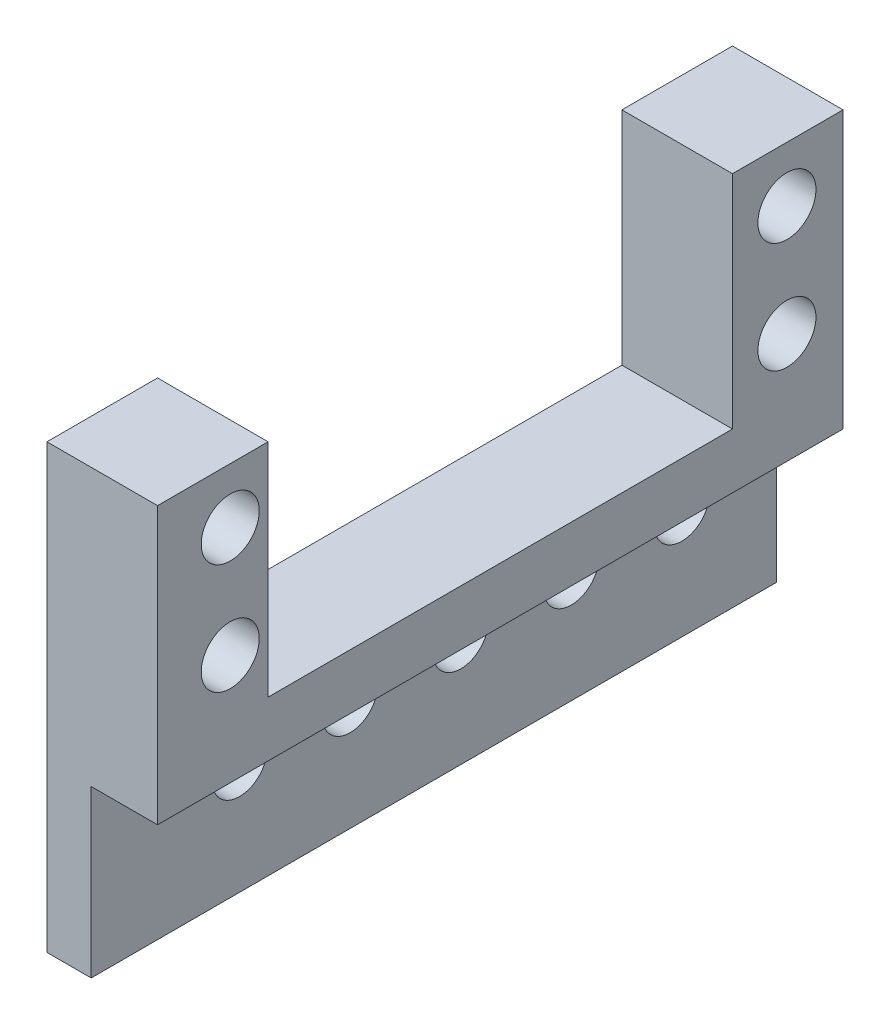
ISO-10303-21;
HEADER;
FILE_DESCRIPTION(('STEP AP214'),'2;1');
FILE_NAME('part.step','',(''),(''),'','','');
FILE_SCHEMA(('AUTOMOTIVE_DESIGN { 1 0 10303 214 1 1 1 1 }'));
ENDSEC;
DATA;
#1=APPLICATION_CONTEXT('core data for automotive mechanical design processes');
#2=APPLICATION_PROTOCOL_DEFINITION('international standard','automotive_design',2000,#1);
#3=PRODUCT_CONTEXT('',#1,'mechanical');
#4=PRODUCT('Part','Part','',(#3));
#5=PRODUCT_RELATED_PRODUCT_CATEGORY('part','',(#4));
#6=PRODUCT_DEFINITION_FORMATION('','',#4);
#7=PRODUCT_DEFINITION_CONTEXT('part definition',#1,'design');
#8=PRODUCT_DEFINITION('design','',#6,#7);
#9=PRODUCT_DEFINITION_SHAPE('','',#8);
#10=(LENGTH_UNIT() NAMED_UNIT(*) SI_UNIT(.MILLI.,.METRE.));
#11=(NAMED_UNIT(*) PLANE_ANGLE_UNIT() SI_UNIT($,.RADIAN.));
#12=(NAMED_UNIT(*) SI_UNIT($,.STERADIAN.) SOLID_ANGLE_UNIT());
#13=UNCERTAINTY_MEASURE_WITH_UNIT(LENGTH_MEASURE(1.E-05),#10,'distance_accuracy_value','');
#14=(GEOMETRIC_REPRESENTATION_CONTEXT(3) GLOBAL_UNCERTAINTY_ASSIGNED_CONTEXT((#13)) GLOBAL_UNIT_ASSIGNED_CONTEXT((#10,
#11,#12)) REPRESENTATION_CONTEXT('',''));
#15=CARTESIAN_POINT('',(0.,0.,0.));
#16=DIRECTION('',(0.,0.,1.));
#17=DIRECTION('',(1.,0.,0.));
#18=AXIS2_PLACEMENT_3D('',#15,#16,#17);
#19=CARTESIAN_POINT('',(0.,5.,0.));
#20=DIRECTION('',(1.,0.,0.));
#21=DIRECTION('',(0.,0.,-1.));
#22=AXIS2_PLACEMENT_3D('',#19,#20,#21);
#23=PLANE('',#22);
#24=CARTESIAN_POINT('',(0.,-5.,8.579278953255));
#25=DIRECTION('',(1.,0.,0.));
#26=DIRECTION('',(0.,0.,-1.));
#27=AXIS2_PLACEMENT_3D('',#24,#25,#26);
#28=CIRCLE('',#27,2.5);
#29=CARTESIAN_POINT('',(0.,-5.,6.079278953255));
#30=VERTEX_POINT('',#29);
#31=EDGE_CURVE('E155',#30,#30,#28,.T.);
#32=ORIENTED_EDGE('',*,*,#31,.T.);
#33=EDGE_LOOP('',(#32));
#34=FACE_BOUND('',#33,.T.);
#35=CARTESIAN_POINT('',(0.,-5.,18.579278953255));
#36=DIRECTION('',(1.,0.,0.));
#37=DIRECTION('',(0.,0.,-1.));
#38=AXIS2_PLACEMENT_3D('',#35,#36,#37);
#39=CIRCLE('',#38,2.5);
#40=CARTESIAN_POINT('',(0.,-5.,16.079278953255));
#41=VERTEX_POINT('',#40);
#42=EDGE_CURVE('E314',#41,#41,#39,.T.);
#43=ORIENTED_EDGE('',*,*,#42,.T.);
#44=EDGE_LOOP('',(#43));
#45=FACE_BOUND('',#44,.T.);
#46=CARTESIAN_POINT('',(0.,-5.,28.579278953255));
#47=DIRECTION('',(1.,0.,0.));
#48=DIRECTION('',(0.,0.,-1.));
#49=AXIS2_PLACEMENT_3D('',#46,#47,#48);
#50=CIRCLE('',#49,2.5);
#51=CARTESIAN_POINT('',(0.,-5.,26.079278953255));
#52=VERTEX_POINT('',#51);
#53=EDGE_CURVE('E318',#52,#52,#50,.T.);
#54=ORIENTED_EDGE('',*,*,#53,.T.);
#55=EDGE_LOOP('',(#54));
#56=FACE_BOUND('',#55,.T.);
#57=CARTESIAN_POINT('',(0.,-5.,38.579278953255));
#58=DIRECTION('',(1.,0.,0.));
#59=DIRECTION('',(0.,0.,-1.));
#60=AXIS2_PLACEMENT_3D('',#57,#58,#59);
#61=CIRCLE('',#60,2.5);
#62=CARTESIAN_POINT('',(0.,-5.,36.079278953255));
#63=VERTEX_POINT('',#62);
#64=EDGE_CURVE('E322',#63,#63,#61,.T.);
#65=ORIENTED_EDGE('',*,*,#64,.T.);
#66=EDGE_LOOP('',(#65));
#67=FACE_BOUND('',#66,.T.);
#68=CARTESIAN_POINT('',(0.,-5.00000000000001,48.579278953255));
#69=DIRECTION('',(1.,0.,0.));
#70=DIRECTION('',(0.,0.,-1.));
#71=AXIS2_PLACEMENT_3D('',#68,#69,#70);
#72=CIRCLE('',#71,2.5);
#73=CARTESIAN_POINT('',(0.,-5.00000000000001,46.079278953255));
#74=VERTEX_POINT('',#73);
#75=EDGE_CURVE('E326',#74,#74,#72,.T.);
#76=ORIENTED_EDGE('',*,*,#75,.T.);
#77=EDGE_LOOP('',(#76));
#78=FACE_BOUND('',#77,.T.);
#79=CARTESIAN_POINT('',(0.,9.99999999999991,55.425));
#80=DIRECTION('',(1.,0.,0.));
#81=DIRECTION('',(0.,0.,-1.));
#82=AXIS2_PLACEMENT_3D('',#79,#80,#81);
#83=CIRCLE('',#82,2.62499999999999);
#84=CARTESIAN_POINT('',(0.,9.99999999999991,52.8));
#85=VERTEX_POINT('',#84);
#86=EDGE_CURVE('E157',#85,#85,#83,.T.);
#87=ORIENTED_EDGE('',*,*,#86,.T.);
#88=EDGE_LOOP('',(#87));
#89=FACE_BOUND('',#88,.T.);
#90=CARTESIAN_POINT('',(0.,19.9999999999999,55.425));
#91=DIRECTION('',(1.,0.,0.));
#92=DIRECTION('',(0.,0.,-1.));
#93=AXIS2_PLACEMENT_3D('',#90,#91,#92);
#94=CIRCLE('',#93,2.625);
#95=CARTESIAN_POINT('',(0.,19.9999999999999,52.8));
#96=VERTEX_POINT('',#95);
#97=EDGE_CURVE('E172',#96,#96,#94,.T.);
#98=ORIENTED_EDGE('',*,*,#97,.T.);
#99=EDGE_LOOP('',(#98));
#100=FACE_BOUND('',#99,.T.);
#101=CARTESIAN_POINT('',(0.,19.9999999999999,5.07500000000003));
#102=DIRECTION('',(1.,0.,0.));
#103=DIRECTION('',(0.,0.,-1.));
#104=AXIS2_PLACEMENT_3D('',#101,#102,#103);
#105=CIRCLE('',#104,2.625);
#106=CARTESIAN_POINT('',(0.,19.9999999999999,2.45000000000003));
#107=VERTEX_POINT('',#106);
#108=EDGE_CURVE('E164',#107,#107,#105,.T.);
#109=ORIENTED_EDGE('',*,*,#108,.T.);
#110=EDGE_LOOP('',(#109));
#111=FACE_BOUND('',#110,.T.);
#112=CARTESIAN_POINT('',(0.,9.99999999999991,5.07500000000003));
#113=DIRECTION('',(1.,0.,0.));
#114=DIRECTION('',(0.,0.,-1.));
#115=AXIS2_PLACEMENT_3D('',#112,#113,#114);
#116=CIRCLE('',#115,2.625);
#117=CARTESIAN_POINT('',(0.,9.99999999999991,2.45000000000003));
#118=VERTEX_POINT('',#117);
#119=EDGE_CURVE('E183',#118,#118,#116,.T.);
#120=ORIENTED_EDGE('',*,*,#119,.T.);
#121=EDGE_LOOP('',(#120));
#122=FACE_BOUND('',#121,.T.);
#123=DIRECTION('',(0.,-1.,0.));
#124=VECTOR('',#123,1.);
#125=CARTESIAN_POINT('',(0.,5.,0.));
#126=LINE('',#125,#124);
#127=CARTESIAN_POINT('',(0.,25.,0.));
#128=VERTEX_POINT('',#127);
#129=CARTESIAN_POINT('',(0.,-15.,0.));
#130=VERTEX_POINT('',#129);
#131=EDGE_CURVE('E248',#128,#130,#126,.T.);
#132=ORIENTED_EDGE('',*,*,#131,.T.);
#133=DIRECTION('',(0.,0.,1.));
#134=VECTOR('',#133,1.);
#135=CARTESIAN_POINT('',(0.,-15.,0.));
#136=LINE('',#135,#134);
#137=CARTESIAN_POINT('',(0.,-15.,62.));
#138=VERTEX_POINT('',#137);
#139=EDGE_CURVE('E129',#130,#138,#136,.T.);
#140=ORIENTED_EDGE('',*,*,#139,.T.);
#141=DIRECTION('',(0.,-1.,0.));
#142=VECTOR('',#141,1.);
#143=CARTESIAN_POINT('',(0.,5.,62.));
#144=LINE('',#143,#142);
#145=CARTESIAN_POINT('',(0.,25.,62.));
#146=VERTEX_POINT('',#145);
#147=EDGE_CURVE('E11',#146,#138,#144,.T.);
#148=ORIENTED_EDGE('',*,*,#147,.F.);
#149=DIRECTION('',(0.,0.,1.));
#150=VECTOR('',#149,1.);
#151=CARTESIAN_POINT('',(0.,25.,62.));
#152=LINE('',#151,#150);
#153=CARTESIAN_POINT('',(0.,25.,52.));
#154=VERTEX_POINT('',#153);
#155=EDGE_CURVE('E229',#154,#146,#152,.T.);
#156=ORIENTED_EDGE('',*,*,#155,.F.);
#157=DIRECTION('',(0.,-1.,0.));
#158=VECTOR('',#157,1.);
#159=CARTESIAN_POINT('',(0.,25.,52.));
#160=LINE('',#159,#158);
#161=CARTESIAN_POINT('',(0.,5.,52.));
#162=VERTEX_POINT('',#161);
#163=EDGE_CURVE('E222',#154,#162,#160,.T.);
#164=ORIENTED_EDGE('',*,*,#163,.T.);
#165=DIRECTION('',(0.,0.,1.));
#166=VECTOR('',#165,1.);
#167=CARTESIAN_POINT('',(0.,5.,0.));
#168=LINE('',#167,#166);
#169=CARTESIAN_POINT('',(0.,5.,10.));
#170=VERTEX_POINT('',#169);
#171=EDGE_CURVE('E242',#170,#162,#168,.T.);
#172=ORIENTED_EDGE('',*,*,#171,.F.);
#173=DIRECTION('',(0.,-1.,0.));
#174=VECTOR('',#173,1.);
#175=CARTESIAN_POINT('',(0.,25.,10.));
#176=LINE('',#175,#174);
#177=CARTESIAN_POINT('',(0.,25.,10.));
#178=VERTEX_POINT('',#177);
#179=EDGE_CURVE('E214',#178,#170,#176,.T.);
#180=ORIENTED_EDGE('',*,*,#179,.F.);
#181=DIRECTION('',(0.,0.,1.));
#182=VECTOR('',#181,1.);
#183=CARTESIAN_POINT('',(0.,25.,0.));
#184=LINE('',#183,#182);
#185=EDGE_CURVE('E191',#128,#178,#184,.T.);
#186=ORIENTED_EDGE('',*,*,#185,.F.);
#187=EDGE_LOOP('',(#132,#140,#148,#156,#164,#172,#180,#186));
#188=FACE_BOUND('',#187,.T.);
#189=ADVANCED_FACE('F45',(#34,#45,#56,#67,#78,#89,#100,#111,#122,#188),#23,.F.);
#190=CARTESIAN_POINT('',(0.,5.,62.));
#191=DIRECTION('',(0.,0.,-1.));
#192=DIRECTION('',(-1.,0.,0.));
#193=AXIS2_PLACEMENT_3D('',#190,#191,#192);
#194=PLANE('',#193);
#195=ORIENTED_EDGE('',*,*,#147,.T.);
#196=DIRECTION('',(-1.,0.,0.));
#197=VECTOR('',#196,1.);
#198=CARTESIAN_POINT('',(4.00000000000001,-15.,62.));
#199=LINE('',#198,#197);
#200=CARTESIAN_POINT('',(4.00000000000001,-15.,62.));
#201=VERTEX_POINT('',#200);
#202=EDGE_CURVE('E132',#201,#138,#199,.T.);
#203=ORIENTED_EDGE('',*,*,#202,.F.);
#204=DIRECTION('',(0.,1.,0.));
#205=VECTOR('',#204,1.);
#206=CARTESIAN_POINT('',(4.00000000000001,0.,62.));
#207=LINE('',#206,#205);
#208=CARTESIAN_POINT('',(4.00000000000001,0.,62.));
#209=VERTEX_POINT('',#208);
#210=EDGE_CURVE('E133',#201,#209,#207,.T.);
#211=ORIENTED_EDGE('',*,*,#210,.T.);
#212=DIRECTION('',(1.,0.,0.));
#213=VECTOR('',#212,1.);
#214=CARTESIAN_POINT('',(0.,0.,62.));
#215=LINE('',#214,#213);
#216=CARTESIAN_POINT('',(10.,0.,62.));
#217=VERTEX_POINT('',#216);
#218=EDGE_CURVE('E218',#209,#217,#215,.T.);
#219=ORIENTED_EDGE('',*,*,#218,.T.);
#220=DIRECTION('',(0.,-1.,0.));
#221=VECTOR('',#220,1.);
#222=CARTESIAN_POINT('',(10.,5.,62.));
#223=LINE('',#222,#221);
#224=CARTESIAN_POINT('',(10.,25.,62.));
#225=VERTEX_POINT('',#224);
#226=EDGE_CURVE('E53',#225,#217,#223,.T.);
#227=ORIENTED_EDGE('',*,*,#226,.F.);
#228=DIRECTION('',(1.,0.,0.));
#229=VECTOR('',#228,1.);
#230=CARTESIAN_POINT('',(0.,25.,62.));
#231=LINE('',#230,#229);
#232=EDGE_CURVE('E235',#146,#225,#231,.T.);
#233=ORIENTED_EDGE('',*,*,#232,.F.);
#234=EDGE_LOOP('',(#195,#203,#211,#219,#227,#233));
#235=FACE_BOUND('',#234,.T.);
#236=ADVANCED_FACE('F272',(#235),#194,.F.);
#237=CARTESIAN_POINT('',(10.,5.,0.));
#238=DIRECTION('',(-1.,0.,0.));
#239=DIRECTION('',(0.,0.,1.));
#240=AXIS2_PLACEMENT_3D('',#237,#238,#239);
#241=PLANE('',#240);
#242=CARTESIAN_POINT('',(10.,9.99999999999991,55.425));
#243=DIRECTION('',(1.,0.,0.));
#244=DIRECTION('',(0.,0.,-1.));
#245=AXIS2_PLACEMENT_3D('',#242,#243,#244);
#246=CIRCLE('',#245,2.62499999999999);
#247=CARTESIAN_POINT('',(10.,9.99999999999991,52.8));
#248=VERTEX_POINT('',#247);
#249=EDGE_CURVE('E176',#248,#248,#246,.T.);
#250=ORIENTED_EDGE('',*,*,#249,.F.);
#251=EDGE_LOOP('',(#250));
#252=FACE_BOUND('',#251,.T.);
#253=CARTESIAN_POINT('',(10.,19.9999999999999,55.425));
#254=DIRECTION('',(1.,0.,0.));
#255=DIRECTION('',(0.,0.,-1.));
#256=AXIS2_PLACEMENT_3D('',#253,#254,#255);
#257=CIRCLE('',#256,2.625);
#258=CARTESIAN_POINT('',(10.,19.9999999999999,52.8));
#259=VERTEX_POINT('',#258);
#260=EDGE_CURVE('E168',#259,#259,#257,.T.);
#261=ORIENTED_EDGE('',*,*,#260,.F.);
#262=EDGE_LOOP('',(#261));
#263=FACE_BOUND('',#262,.T.);
#264=CARTESIAN_POINT('',(10.,19.9999999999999,5.07500000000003));
#265=DIRECTION('',(1.,0.,0.));
#266=DIRECTION('',(0.,0.,-1.));
#267=AXIS2_PLACEMENT_3D('',#264,#265,#266);
#268=CIRCLE('',#267,2.625);
#269=CARTESIAN_POINT('',(10.,19.9999999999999,2.45000000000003));
#270=VERTEX_POINT('',#269);
#271=EDGE_CURVE('E159',#270,#270,#268,.T.);
#272=ORIENTED_EDGE('',*,*,#271,.F.);
#273=EDGE_LOOP('',(#272));
#274=FACE_BOUND('',#273,.T.);
#275=CARTESIAN_POINT('',(10.,9.99999999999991,5.07500000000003));
#276=DIRECTION('',(1.,0.,0.));
#277=DIRECTION('',(0.,0.,-1.));
#278=AXIS2_PLACEMENT_3D('',#275,#276,#277);
#279=CIRCLE('',#278,2.625);
#280=CARTESIAN_POINT('',(10.,9.99999999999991,2.45000000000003));
#281=VERTEX_POINT('',#280);
#282=EDGE_CURVE('E163',#281,#281,#279,.T.);
#283=ORIENTED_EDGE('',*,*,#282,.F.);
#284=EDGE_LOOP('',(#283));
#285=FACE_BOUND('',#284,.T.);
#286=DIRECTION('',(0.,0.,-1.));
#287=VECTOR('',#286,1.);
#288=CARTESIAN_POINT('',(10.,0.,0.));
#289=LINE('',#288,#287);
#290=CARTESIAN_POINT('',(10.,0.,0.));
#291=VERTEX_POINT('',#290);
#292=EDGE_CURVE('E251',#217,#291,#289,.T.);
#293=ORIENTED_EDGE('',*,*,#292,.T.);
#294=DIRECTION('',(0.,-1.,0.));
#295=VECTOR('',#294,1.);
#296=CARTESIAN_POINT('',(10.,5.,0.));
#297=LINE('',#296,#295);
#298=CARTESIAN_POINT('',(10.,25.,0.));
#299=VERTEX_POINT('',#298);
#300=EDGE_CURVE('E258',#299,#291,#297,.T.);
#301=ORIENTED_EDGE('',*,*,#300,.F.);
#302=DIRECTION('',(0.,0.,-1.));
#303=VECTOR('',#302,1.);
#304=CARTESIAN_POINT('',(10.,25.,0.));
#305=LINE('',#304,#303);
#306=CARTESIAN_POINT('',(10.,25.,10.));
#307=VERTEX_POINT('',#306);
#308=EDGE_CURVE('E199',#307,#299,#305,.T.);
#309=ORIENTED_EDGE('',*,*,#308,.F.);
#310=DIRECTION('',(0.,-1.,0.));
#311=VECTOR('',#310,1.);
#312=CARTESIAN_POINT('',(10.,25.,10.));
#313=LINE('',#312,#311);
#314=CARTESIAN_POINT('',(10.,5.,10.));
#315=VERTEX_POINT('',#314);
#316=EDGE_CURVE('E207',#307,#315,#313,.T.);
#317=ORIENTED_EDGE('',*,*,#316,.T.);
#318=DIRECTION('',(0.,0.,-1.));
#319=VECTOR('',#318,1.);
#320=CARTESIAN_POINT('',(10.,5.,0.));
#321=LINE('',#320,#319);
#322=CARTESIAN_POINT('',(10.,5.,52.));
#323=VERTEX_POINT('',#322);
#324=EDGE_CURVE('E245',#323,#315,#321,.T.);
#325=ORIENTED_EDGE('',*,*,#324,.F.);
#326=DIRECTION('',(0.,-1.,0.));
#327=VECTOR('',#326,1.);
#328=CARTESIAN_POINT('',(10.,25.,52.));
#329=LINE('',#328,#327);
#330=CARTESIAN_POINT('',(10.,25.,52.));
#331=VERTEX_POINT('',#330);
#332=EDGE_CURVE('E187',#331,#323,#329,.T.);
#333=ORIENTED_EDGE('',*,*,#332,.F.);
#334=DIRECTION('',(0.,0.,-1.));
#335=VECTOR('',#334,1.);
#336=CARTESIAN_POINT('',(10.,25.,62.));
#337=LINE('',#336,#335);
#338=EDGE_CURVE('E232',#225,#331,#337,.T.);
#339=ORIENTED_EDGE('',*,*,#338,.F.);
#340=ORIENTED_EDGE('',*,*,#226,.T.);
#341=EDGE_LOOP('',(#293,#301,#309,#317,#325,#333,#339,#340));
#342=FACE_BOUND('',#341,.T.);
#343=ADVANCED_FACE('F265',(#252,#263,#274,#285,#342),#241,.F.);
#344=CARTESIAN_POINT('',(0.,5.,0.));
#345=DIRECTION('',(0.,0.,1.));
#346=DIRECTION('',(1.,0.,0.));
#347=AXIS2_PLACEMENT_3D('',#344,#345,#346);
#348=PLANE('',#347);
#349=DIRECTION('',(-1.,0.,0.));
#350=VECTOR('',#349,1.);
#351=CARTESIAN_POINT('',(0.,0.,0.));
#352=LINE('',#351,#350);
#353=CARTESIAN_POINT('',(4.,0.,0.));
#354=VERTEX_POINT('',#353);
#355=EDGE_CURVE('E143',#291,#354,#352,.T.);
#356=ORIENTED_EDGE('',*,*,#355,.T.);
#357=DIRECTION('',(0.,-1.,0.));
#358=VECTOR('',#357,1.);
#359=CARTESIAN_POINT('',(4.,0.,0.));
#360=LINE('',#359,#358);
#361=CARTESIAN_POINT('',(4.,-15.,0.));
#362=VERTEX_POINT('',#361);
#363=EDGE_CURVE('E60',#354,#362,#360,.T.);
#364=ORIENTED_EDGE('',*,*,#363,.T.);
#365=DIRECTION('',(-1.,0.,0.));
#366=VECTOR('',#365,1.);
#367=CARTESIAN_POINT('',(4.,-15.,0.));
#368=LINE('',#367,#366);
#369=EDGE_CURVE('E123',#362,#130,#368,.T.);
#370=ORIENTED_EDGE('',*,*,#369,.T.);
#371=ORIENTED_EDGE('',*,*,#131,.F.);
#372=DIRECTION('',(-1.,0.,0.));
#373=VECTOR('',#372,1.);
#374=CARTESIAN_POINT('',(0.,25.,0.));
#375=LINE('',#374,#373);
#376=EDGE_CURVE('E203',#299,#128,#375,.T.);
#377=ORIENTED_EDGE('',*,*,#376,.F.);
#378=ORIENTED_EDGE('',*,*,#300,.T.);
#379=EDGE_LOOP('',(#356,#364,#370,#371,#377,#378));
#380=FACE_BOUND('',#379,.T.);
#381=ADVANCED_FACE('F140',(#380),#348,.F.);
#382=CARTESIAN_POINT('',(0.,5.,0.));
#383=DIRECTION('',(0.,1.,0.));
#384=DIRECTION('',(0.,0.,1.));
#385=AXIS2_PLACEMENT_3D('',#382,#383,#384);
#386=PLANE('',#385);
#387=DIRECTION('',(1.,0.,0.));
#388=VECTOR('',#387,1.);
#389=CARTESIAN_POINT('',(0.,5.,10.));
#390=LINE('',#389,#388);
#391=EDGE_CURVE('E196',#170,#315,#390,.T.);
#392=ORIENTED_EDGE('',*,*,#391,.F.);
#393=ORIENTED_EDGE('',*,*,#171,.T.);
#394=DIRECTION('',(-1.,0.,0.));
#395=VECTOR('',#394,1.);
#396=CARTESIAN_POINT('',(0.,5.,52.));
#397=LINE('',#396,#395);
#398=EDGE_CURVE('E68',#323,#162,#397,.T.);
#399=ORIENTED_EDGE('',*,*,#398,.F.);
#400=ORIENTED_EDGE('',*,*,#324,.T.);
#401=EDGE_LOOP('',(#392,#393,#399,#400));
#402=FACE_BOUND('',#401,.T.);
#403=ADVANCED_FACE('F285',(#402),#386,.T.);
#404=CARTESIAN_POINT('',(0.,0.,0.));
#405=DIRECTION('',(0.,1.,0.));
#406=DIRECTION('',(0.,0.,1.));
#407=AXIS2_PLACEMENT_3D('',#404,#405,#406);
#408=PLANE('',#407);
#409=ORIENTED_EDGE('',*,*,#218,.F.);
#410=DIRECTION('',(0.,0.,-1.));
#411=VECTOR('',#410,1.);
#412=CARTESIAN_POINT('',(4.,0.,0.));
#413=LINE('',#412,#411);
#414=EDGE_CURVE('E145',#209,#354,#413,.T.);
#415=ORIENTED_EDGE('',*,*,#414,.T.);
#416=ORIENTED_EDGE('',*,*,#355,.F.);
#417=ORIENTED_EDGE('',*,*,#292,.F.);
#418=EDGE_LOOP('',(#409,#415,#416,#417));
#419=FACE_BOUND('',#418,.T.);
#420=ADVANCED_FACE('F271',(#419),#408,.F.);
#421=CARTESIAN_POINT('',(0.,25.,52.));
#422=DIRECTION('',(0.,0.,1.));
#423=DIRECTION('',(1.,0.,0.));
#424=AXIS2_PLACEMENT_3D('',#421,#422,#423);
#425=PLANE('',#424);
#426=ORIENTED_EDGE('',*,*,#398,.T.);
#427=ORIENTED_EDGE('',*,*,#163,.F.);
#428=DIRECTION('',(-1.,0.,0.));
#429=VECTOR('',#428,1.);
#430=CARTESIAN_POINT('',(0.,25.,52.));
#431=LINE('',#430,#429);
#432=EDGE_CURVE('E226',#331,#154,#431,.T.);
#433=ORIENTED_EDGE('',*,*,#432,.F.);
#434=ORIENTED_EDGE('',*,*,#332,.T.);
#435=EDGE_LOOP('',(#426,#427,#433,#434));
#436=FACE_BOUND('',#435,.T.);
#437=ADVANCED_FACE('F289',(#436),#425,.F.);
#438=CARTESIAN_POINT('',(0.,25.,0.));
#439=DIRECTION('',(0.,-1.,0.));
#440=DIRECTION('',(0.,0.,-1.));
#441=AXIS2_PLACEMENT_3D('',#438,#439,#440);
#442=PLANE('',#441);
#443=ORIENTED_EDGE('',*,*,#155,.T.);
#444=ORIENTED_EDGE('',*,*,#232,.T.);
#445=ORIENTED_EDGE('',*,*,#338,.T.);
#446=ORIENTED_EDGE('',*,*,#432,.T.);
#447=EDGE_LOOP('',(#443,#444,#445,#446));
#448=FACE_BOUND('',#447,.T.);
#449=ADVANCED_FACE('F291',(#448),#442,.F.);
#450=CARTESIAN_POINT('',(0.,25.,10.));
#451=DIRECTION('',(0.,0.,-1.));
#452=DIRECTION('',(-1.,0.,0.));
#453=AXIS2_PLACEMENT_3D('',#450,#451,#452);
#454=PLANE('',#453);
#455=ORIENTED_EDGE('',*,*,#391,.T.);
#456=ORIENTED_EDGE('',*,*,#316,.F.);
#457=DIRECTION('',(1.,0.,0.));
#458=VECTOR('',#457,1.);
#459=CARTESIAN_POINT('',(0.,25.,10.));
#460=LINE('',#459,#458);
#461=EDGE_CURVE('E195',#178,#307,#460,.T.);
#462=ORIENTED_EDGE('',*,*,#461,.F.);
#463=ORIENTED_EDGE('',*,*,#179,.T.);
#464=EDGE_LOOP('',(#455,#456,#462,#463));
#465=FACE_BOUND('',#464,.T.);
#466=ADVANCED_FACE('F283',(#465),#454,.F.);
#467=CARTESIAN_POINT('',(0.,25.,0.));
#468=DIRECTION('',(0.,1.,0.));
#469=DIRECTION('',(0.,0.,1.));
#470=AXIS2_PLACEMENT_3D('',#467,#468,#469);
#471=PLANE('',#470);
#472=ORIENTED_EDGE('',*,*,#185,.T.);
#473=ORIENTED_EDGE('',*,*,#461,.T.);
#474=ORIENTED_EDGE('',*,*,#308,.T.);
#475=ORIENTED_EDGE('',*,*,#376,.T.);
#476=EDGE_LOOP('',(#472,#473,#474,#475));
#477=FACE_BOUND('',#476,.T.);
#478=ADVANCED_FACE('F279',(#477),#471,.T.);
#479=CARTESIAN_POINT('',(0.,9.99999999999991,5.07500000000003));
#480=DIRECTION('',(1.,0.,0.));
#481=DIRECTION('',(0.,0.,-1.));
#482=AXIS2_PLACEMENT_3D('',#479,#480,#481);
#483=CYLINDRICAL_SURFACE('',#482,2.625);
#484=ORIENTED_EDGE('',*,*,#119,.F.);
#485=EDGE_LOOP('',(#484));
#486=FACE_BOUND('',#485,.T.);
#487=ORIENTED_EDGE('',*,*,#282,.T.);
#488=EDGE_LOOP('',(#487));
#489=FACE_BOUND('',#488,.T.);
#490=ADVANCED_FACE('F335',(#486,#489),#483,.F.);
#491=CARTESIAN_POINT('',(0.,19.9999999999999,5.07500000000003));
#492=DIRECTION('',(1.,0.,0.));
#493=DIRECTION('',(0.,0.,-1.));
#494=AXIS2_PLACEMENT_3D('',#491,#492,#493);
#495=CYLINDRICAL_SURFACE('',#494,2.625);
#496=ORIENTED_EDGE('',*,*,#108,.F.);
#497=EDGE_LOOP('',(#496));
#498=FACE_BOUND('',#497,.T.);
#499=ORIENTED_EDGE('',*,*,#271,.T.);
#500=EDGE_LOOP('',(#499));
#501=FACE_BOUND('',#500,.T.);
#502=ADVANCED_FACE('F338',(#498,#501),#495,.F.);
#503=CARTESIAN_POINT('',(0.,19.9999999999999,55.425));
#504=DIRECTION('',(1.,0.,0.));
#505=DIRECTION('',(0.,0.,-1.));
#506=AXIS2_PLACEMENT_3D('',#503,#504,#505);
#507=CYLINDRICAL_SURFACE('',#506,2.625);
#508=ORIENTED_EDGE('',*,*,#97,.F.);
#509=EDGE_LOOP('',(#508));
#510=FACE_BOUND('',#509,.T.);
#511=ORIENTED_EDGE('',*,*,#260,.T.);
#512=EDGE_LOOP('',(#511));
#513=FACE_BOUND('',#512,.T.);
#514=ADVANCED_FACE('F402',(#510,#513),#507,.F.);
#515=CARTESIAN_POINT('',(0.,9.99999999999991,55.425));
#516=DIRECTION('',(1.,0.,0.));
#517=DIRECTION('',(0.,0.,-1.));
#518=AXIS2_PLACEMENT_3D('',#515,#516,#517);
#519=CYLINDRICAL_SURFACE('',#518,2.62499999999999);
#520=ORIENTED_EDGE('',*,*,#86,.F.);
#521=EDGE_LOOP('',(#520));
#522=FACE_BOUND('',#521,.T.);
#523=ORIENTED_EDGE('',*,*,#249,.T.);
#524=EDGE_LOOP('',(#523));
#525=FACE_BOUND('',#524,.T.);
#526=ADVANCED_FACE('F412',(#522,#525),#519,.F.);
#527=CARTESIAN_POINT('',(4.,-15.,0.));
#528=DIRECTION('',(0.,-1.,0.));
#529=DIRECTION('',(0.,0.,-1.));
#530=AXIS2_PLACEMENT_3D('',#527,#528,#529);
#531=PLANE('',#530);
#532=ORIENTED_EDGE('',*,*,#139,.F.);
#533=ORIENTED_EDGE('',*,*,#369,.F.);
#534=DIRECTION('',(0.,0.,1.));
#535=VECTOR('',#534,1.);
#536=CARTESIAN_POINT('',(4.,-15.,0.));
#537=LINE('',#536,#535);
#538=EDGE_CURVE('E126',#362,#201,#537,.T.);
#539=ORIENTED_EDGE('',*,*,#538,.T.);
#540=ORIENTED_EDGE('',*,*,#202,.T.);
#541=EDGE_LOOP('',(#532,#533,#539,#540));
#542=FACE_BOUND('',#541,.T.);
#543=ADVANCED_FACE('F124',(#542),#531,.T.);
#544=CARTESIAN_POINT('',(4.,0.,0.));
#545=DIRECTION('',(1.,0.,0.));
#546=DIRECTION('',(0.,0.,-1.));
#547=AXIS2_PLACEMENT_3D('',#544,#545,#546);
#548=PLANE('',#547);
#549=CARTESIAN_POINT('',(4.,-5.,8.579278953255));
#550=DIRECTION('',(1.,0.,0.));
#551=DIRECTION('',(0.,0.,-1.));
#552=AXIS2_PLACEMENT_3D('',#549,#550,#551);
#553=CIRCLE('',#552,2.5);
#554=CARTESIAN_POINT('',(4.,-5.,6.079278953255));
#555=VERTEX_POINT('',#554);
#556=EDGE_CURVE('E511',#555,#555,#553,.T.);
#557=ORIENTED_EDGE('',*,*,#556,.F.);
#558=EDGE_LOOP('',(#557));
#559=FACE_BOUND('',#558,.T.);
#560=CARTESIAN_POINT('',(4.,-5.,18.579278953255));
#561=DIRECTION('',(1.,0.,0.));
#562=DIRECTION('',(0.,0.,-1.));
#563=AXIS2_PLACEMENT_3D('',#560,#561,#562);
#564=CIRCLE('',#563,2.5);
#565=CARTESIAN_POINT('',(4.,-5.,16.079278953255));
#566=VERTEX_POINT('',#565);
#567=EDGE_CURVE('E513',#566,#566,#564,.T.);
#568=ORIENTED_EDGE('',*,*,#567,.F.);
#569=EDGE_LOOP('',(#568));
#570=FACE_BOUND('',#569,.T.);
#571=CARTESIAN_POINT('',(4.,-5.,28.579278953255));
#572=DIRECTION('',(1.,0.,0.));
#573=DIRECTION('',(0.,0.,-1.));
#574=AXIS2_PLACEMENT_3D('',#571,#572,#573);
#575=CIRCLE('',#574,2.5);
#576=CARTESIAN_POINT('',(4.,-5.,26.079278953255));
#577=VERTEX_POINT('',#576);
#578=EDGE_CURVE('E523',#577,#577,#575,.T.);
#579=ORIENTED_EDGE('',*,*,#578,.F.);
#580=EDGE_LOOP('',(#579));
#581=FACE_BOUND('',#580,.T.);
#582=CARTESIAN_POINT('',(4.,-5.,38.579278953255));
#583=DIRECTION('',(1.,0.,0.));
#584=DIRECTION('',(0.,0.,-1.));
#585=AXIS2_PLACEMENT_3D('',#582,#583,#584);
#586=CIRCLE('',#585,2.5);
#587=CARTESIAN_POINT('',(4.,-5.,36.079278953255));
#588=VERTEX_POINT('',#587);
#589=EDGE_CURVE('E529',#588,#588,#586,.T.);
#590=ORIENTED_EDGE('',*,*,#589,.F.);
#591=EDGE_LOOP('',(#590));
#592=FACE_BOUND('',#591,.T.);
#593=CARTESIAN_POINT('',(4.00000000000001,-5.00000000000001,48.579278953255));
#594=DIRECTION('',(1.,0.,0.));
#595=DIRECTION('',(0.,0.,-1.));
#596=AXIS2_PLACEMENT_3D('',#593,#594,#595);
#597=CIRCLE('',#596,2.5);
#598=CARTESIAN_POINT('',(4.00000000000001,-5.00000000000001,46.079278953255));
#599=VERTEX_POINT('',#598);
#600=EDGE_CURVE('E535',#599,#599,#597,.T.);
#601=ORIENTED_EDGE('',*,*,#600,.F.);
#602=EDGE_LOOP('',(#601));
#603=FACE_BOUND('',#602,.T.);
#604=ORIENTED_EDGE('',*,*,#414,.F.);
#605=ORIENTED_EDGE('',*,*,#210,.F.);
#606=ORIENTED_EDGE('',*,*,#538,.F.);
#607=ORIENTED_EDGE('',*,*,#363,.F.);
#608=EDGE_LOOP('',(#604,#605,#606,#607));
#609=FACE_BOUND('',#608,.T.);
#610=ADVANCED_FACE('F135',(#559,#570,#581,#592,#603,#609),#548,.T.);
#611=CARTESIAN_POINT('',(0.,-5.00000000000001,48.579278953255));
#612=DIRECTION('',(1.,0.,0.));
#613=DIRECTION('',(0.,0.,-1.));
#614=AXIS2_PLACEMENT_3D('',#611,#612,#613);
#615=CYLINDRICAL_SURFACE('',#614,2.5);
#616=ORIENTED_EDGE('',*,*,#75,.F.);
#617=EDGE_LOOP('',(#616));
#618=FACE_BOUND('',#617,.T.);
#619=ORIENTED_EDGE('',*,*,#600,.T.);
#620=EDGE_LOOP('',(#619));
#621=FACE_BOUND('',#620,.T.);
#622=ADVANCED_FACE('F455',(#618,#621),#615,.F.);
#623=CARTESIAN_POINT('',(0.,-5.,38.579278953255));
#624=DIRECTION('',(1.,0.,0.));
#625=DIRECTION('',(0.,0.,-1.));
#626=AXIS2_PLACEMENT_3D('',#623,#624,#625);
#627=CYLINDRICAL_SURFACE('',#626,2.5);
#628=ORIENTED_EDGE('',*,*,#64,.F.);
#629=EDGE_LOOP('',(#628));
#630=FACE_BOUND('',#629,.T.);
#631=ORIENTED_EDGE('',*,*,#589,.T.);
#632=EDGE_LOOP('',(#631));
#633=FACE_BOUND('',#632,.T.);
#634=ADVANCED_FACE('F465',(#630,#633),#627,.F.);
#635=CARTESIAN_POINT('',(0.,-5.,28.579278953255));
#636=DIRECTION('',(1.,0.,0.));
#637=DIRECTION('',(0.,0.,-1.));
#638=AXIS2_PLACEMENT_3D('',#635,#636,#637);
#639=CYLINDRICAL_SURFACE('',#638,2.5);
#640=ORIENTED_EDGE('',*,*,#53,.F.);
#641=EDGE_LOOP('',(#640));
#642=FACE_BOUND('',#641,.T.);
#643=ORIENTED_EDGE('',*,*,#578,.T.);
#644=EDGE_LOOP('',(#643));
#645=FACE_BOUND('',#644,.T.);
#646=ADVANCED_FACE('F475',(#642,#645),#639,.F.);
#647=CARTESIAN_POINT('',(0.,-5.,18.579278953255));
#648=DIRECTION('',(1.,0.,0.));
#649=DIRECTION('',(0.,0.,-1.));
#650=AXIS2_PLACEMENT_3D('',#647,#648,#649);
#651=CYLINDRICAL_SURFACE('',#650,2.5);
#652=ORIENTED_EDGE('',*,*,#42,.F.);
#653=EDGE_LOOP('',(#652));
#654=FACE_BOUND('',#653,.T.);
#655=ORIENTED_EDGE('',*,*,#567,.T.);
#656=EDGE_LOOP('',(#655));
#657=FACE_BOUND('',#656,.T.);
#658=ADVANCED_FACE('F485',(#654,#657),#651,.F.);
#659=CARTESIAN_POINT('',(0.,-5.,8.579278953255));
#660=DIRECTION('',(1.,0.,0.));
#661=DIRECTION('',(0.,0.,-1.));
#662=AXIS2_PLACEMENT_3D('',#659,#660,#661);
#663=CYLINDRICAL_SURFACE('',#662,2.5);
#664=ORIENTED_EDGE('',*,*,#31,.F.);
#665=EDGE_LOOP('',(#664));
#666=FACE_BOUND('',#665,.T.);
#667=ORIENTED_EDGE('',*,*,#556,.T.);
#668=EDGE_LOOP('',(#667));
#669=FACE_BOUND('',#668,.T.);
#670=ADVANCED_FACE('F495',(#666,#669),#663,.F.);
#671=CLOSED_SHELL('',(#189,#236,#343,#381,#403,#420,#437,#449,#466,#478,#490,#502,#514,#526,
#543,#610,#622,#634,#646,#658,#670));
#672=MANIFOLD_SOLID_BREP('B2',#671);
#673=ADVANCED_BREP_SHAPE_REPRESENTATION('',(#18,#672),#14);
#674=SHAPE_DEFINITION_REPRESENTATION(#9,#673);
ENDSEC;
END-ISO-10303-21;
